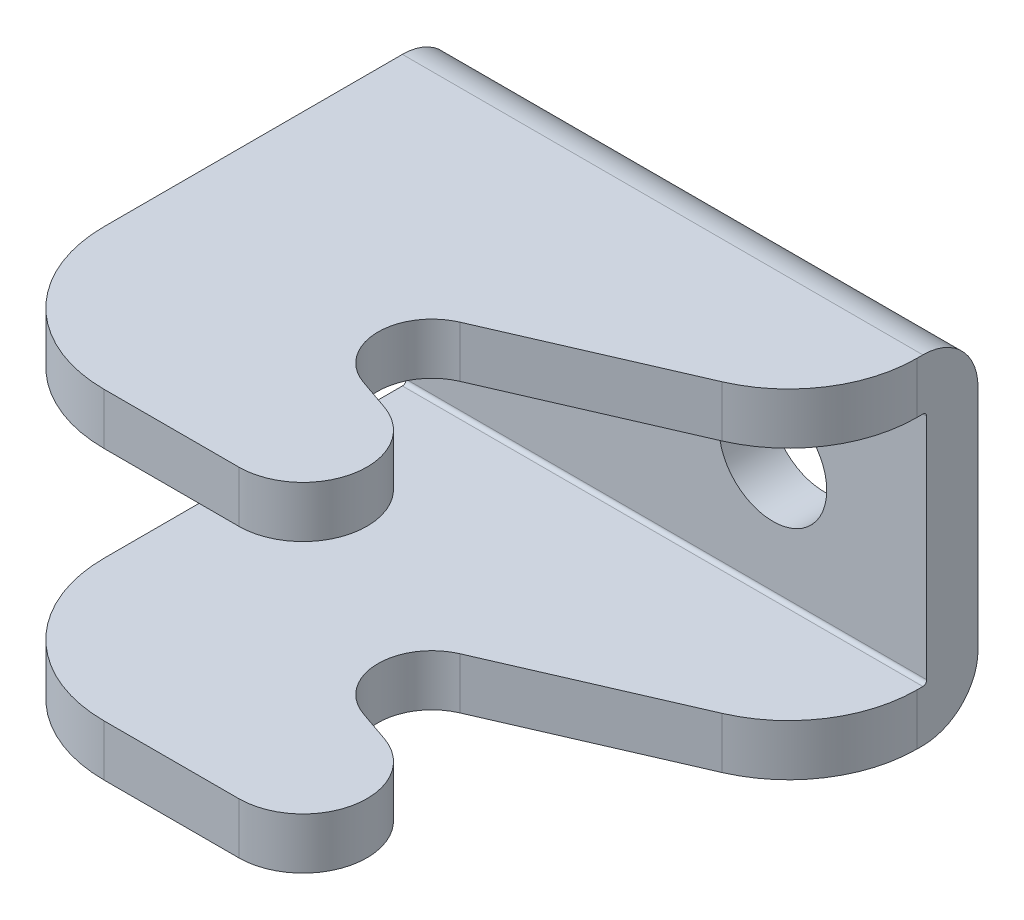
ISO-10303-21;
HEADER;
FILE_DESCRIPTION(('STEP AP214'),'2;1');
FILE_NAME('part.step','',(''),(''),'','','');
FILE_SCHEMA(('AUTOMOTIVE_DESIGN { 1 0 10303 214 1 1 1 1 }'));
ENDSEC;
DATA;
#1=APPLICATION_CONTEXT('core data for automotive mechanical design processes');
#2=APPLICATION_PROTOCOL_DEFINITION('international standard','automotive_design',2000,#1);
#3=PRODUCT_CONTEXT('',#1,'mechanical');
#4=PRODUCT('Part','Part','',(#3));
#5=PRODUCT_RELATED_PRODUCT_CATEGORY('part','',(#4));
#6=PRODUCT_DEFINITION_FORMATION('','',#4);
#7=PRODUCT_DEFINITION_CONTEXT('part definition',#1,'design');
#8=PRODUCT_DEFINITION('design','',#6,#7);
#9=PRODUCT_DEFINITION_SHAPE('','',#8);
#10=(LENGTH_UNIT() NAMED_UNIT(*) SI_UNIT(.MILLI.,.METRE.));
#11=(NAMED_UNIT(*) PLANE_ANGLE_UNIT() SI_UNIT($,.RADIAN.));
#12=(NAMED_UNIT(*) SI_UNIT($,.STERADIAN.) SOLID_ANGLE_UNIT());
#13=UNCERTAINTY_MEASURE_WITH_UNIT(LENGTH_MEASURE(1.E-05),#10,'distance_accuracy_value','');
#14=(GEOMETRIC_REPRESENTATION_CONTEXT(3) GLOBAL_UNCERTAINTY_ASSIGNED_CONTEXT((#13)) GLOBAL_UNIT_ASSIGNED_CONTEXT((#10,
#11,#12)) REPRESENTATION_CONTEXT('',''));
#15=CARTESIAN_POINT('',(0.,0.,0.));
#16=DIRECTION('',(0.,0.,1.));
#17=DIRECTION('',(1.,0.,0.));
#18=AXIS2_PLACEMENT_3D('',#15,#16,#17);
#19=CARTESIAN_POINT('',(36.7623990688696,23.3239179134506,2.30527748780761));
#20=DIRECTION('',(-0.326614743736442,0.,0.945157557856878));
#21=DIRECTION('',(0.945157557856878,0.,0.326614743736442));
#22=AXIS2_PLACEMENT_3D('',#19,#20,#21);
#23=PLANE('',#22);
#24=DIRECTION('',(0.,1.,0.));
#25=VECTOR('',#24,1.);
#26=CARTESIAN_POINT('',(38.0148268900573,23.3239179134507,2.7380745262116));
#27=LINE('',#26,#25);
#28=CARTESIAN_POINT('',(38.0148268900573,23.3239179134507,2.73807452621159));
#29=VERTEX_POINT('',#28);
#30=CARTESIAN_POINT('',(38.0148268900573,25.3239179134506,2.73807452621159));
#31=VERTEX_POINT('',#30);
#32=EDGE_CURVE('E209',#29,#31,#27,.T.);
#33=ORIENTED_EDGE('',*,*,#32,.F.);
#34=DIRECTION('',(0.945157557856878,0.,0.326614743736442));
#35=VECTOR('',#34,1.);
#36=CARTESIAN_POINT('',(36.7623990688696,23.3239179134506,2.30527748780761));
#37=LINE('',#36,#35);
#38=CARTESIAN_POINT('',(36.7623990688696,23.3239179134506,2.30527748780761));
#39=VERTEX_POINT('',#38);
#40=EDGE_CURVE('E222',#39,#29,#37,.T.);
#41=ORIENTED_EDGE('',*,*,#40,.F.);
#42=DIRECTION('',(0.,1.,0.));
#43=VECTOR('',#42,1.);
#44=CARTESIAN_POINT('',(36.7623990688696,23.3239179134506,2.30527748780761));
#45=LINE('',#44,#43);
#46=CARTESIAN_POINT('',(36.7623990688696,25.3239179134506,2.3052774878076));
#47=VERTEX_POINT('',#46);
#48=EDGE_CURVE('E215',#39,#47,#45,.T.);
#49=ORIENTED_EDGE('',*,*,#48,.T.);
#50=DIRECTION('',(0.945157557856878,0.,0.326614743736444));
#51=VECTOR('',#50,1.);
#52=CARTESIAN_POINT('',(36.7623990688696,25.3239179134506,2.3052774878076));
#53=LINE('',#52,#51);
#54=EDGE_CURVE('E182',#47,#31,#53,.T.);
#55=ORIENTED_EDGE('',*,*,#54,.T.);
#56=EDGE_LOOP('',(#33,#41,#49,#55));
#57=FACE_BOUND('',#56,.T.);
#58=ADVANCED_FACE('F14',(#57),#23,.F.);
#59=CARTESIAN_POINT('',(31.9482900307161,25.3239179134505,2.10096842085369));
#60=DIRECTION('',(0.,-1.,0.));
#61=DIRECTION('',(1.,0.,0.));
#62=AXIS2_PLACEMENT_3D('',#59,#60,#61);
#63=PLANE('',#62);
#64=DIRECTION('',(0.,0.,1.));
#65=VECTOR('',#64,1.);
#66=CARTESIAN_POINT('',(26.4482900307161,25.3239179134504,2.10096842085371));
#67=LINE('',#66,#65);
#68=CARTESIAN_POINT('',(26.4482900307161,25.3239179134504,-9.52955338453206));
#69=VERTEX_POINT('',#68);
#70=CARTESIAN_POINT('',(26.4482900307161,25.3239179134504,2.10096842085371));
#71=VERTEX_POINT('',#70);
#72=EDGE_CURVE('E196',#69,#71,#67,.T.);
#73=ORIENTED_EDGE('',*,*,#72,.T.);
#74=CARTESIAN_POINT('',(31.9482900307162,25.3239179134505,2.10096842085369));
#75=DIRECTION('',(0.,1.,0.));
#76=DIRECTION('',(-1.,0.,0.));
#77=AXIS2_PLACEMENT_3D('',#74,#75,#76);
#78=CIRCLE('',#77,5.5);
#79=CARTESIAN_POINT('',(31.9482900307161,25.3239179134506,7.60096842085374));
#80=VERTEX_POINT('',#79);
#81=EDGE_CURVE('E204',#80,#71,#78,.F.);
#82=ORIENTED_EDGE('',*,*,#81,.F.);
#83=DIRECTION('',(-1.,0.,0.));
#84=VECTOR('',#83,1.);
#85=CARTESIAN_POINT('',(37.1982900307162,25.3239179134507,7.60096842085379));
#86=LINE('',#85,#84);
#87=CARTESIAN_POINT('',(37.1982900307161,25.3239179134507,7.60096842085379));
#88=VERTEX_POINT('',#87);
#89=EDGE_CURVE('E207',#80,#88,#86,.F.);
#90=ORIENTED_EDGE('',*,*,#89,.T.);
#91=CARTESIAN_POINT('',(37.1982900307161,25.3239179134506,5.10096842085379));
#92=DIRECTION('',(0.,1.,0.));
#93=DIRECTION('',(-1.,0.,0.));
#94=AXIS2_PLACEMENT_3D('',#91,#92,#93);
#95=CIRCLE('',#94,2.5);
#96=EDGE_CURVE('E208',#31,#88,#95,.F.);
#97=ORIENTED_EDGE('',*,*,#96,.F.);
#98=ORIENTED_EDGE('',*,*,#54,.F.);
#99=CARTESIAN_POINT('',(37.4482900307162,25.3239179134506,0.320446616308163));
#100=DIRECTION('',(0.,1.,0.));
#101=DIRECTION('',(-1.,0.,0.));
#102=AXIS2_PLACEMENT_3D('',#99,#100,#101);
#103=CIRCLE('',#102,2.1);
#104=CARTESIAN_POINT('',(36.6109646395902,25.3239179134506,-1.60540025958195));
#105=VERTEX_POINT('',#104);
#106=EDGE_CURVE('E212',#47,#105,#103,.F.);
#107=ORIENTED_EDGE('',*,*,#106,.T.);
#108=DIRECTION('',(-0.917069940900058,0.,0.398726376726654));
#109=VECTOR('',#108,1.);
#110=CARTESIAN_POINT('',(43.7419219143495,25.3239179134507,-4.70581891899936));
#111=LINE('',#110,#109);
#112=CARTESIAN_POINT('',(43.7419219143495,25.3239179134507,-4.70581891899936));
#113=VERTEX_POINT('',#112);
#114=EDGE_CURVE('E178',#105,#113,#111,.F.);
#115=ORIENTED_EDGE('',*,*,#114,.T.);
#116=CARTESIAN_POINT('',(41.7482900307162,25.3239179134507,-9.2911686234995));
#117=DIRECTION('',(0.,1.,0.));
#118=DIRECTION('',(-1.,0.,0.));
#119=AXIS2_PLACEMENT_3D('',#116,#117,#118);
#120=CIRCLE('',#119,4.99999999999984);
#121=CARTESIAN_POINT('',(46.7482900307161,25.3239179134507,-9.29116862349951));
#122=VERTEX_POINT('',#121);
#123=EDGE_CURVE('E17',#122,#113,#120,.F.);
#124=ORIENTED_EDGE('',*,*,#123,.F.);
#125=DIRECTION('',(0.,0.,1.));
#126=VECTOR('',#125,1.);
#127=CARTESIAN_POINT('',(46.7482900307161,25.3239179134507,-21.2035576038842));
#128=LINE('',#127,#126);
#129=CARTESIAN_POINT('',(46.7482900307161,25.3239179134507,-9.52955338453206));
#130=VERTEX_POINT('',#129);
#131=EDGE_CURVE('E175',#122,#130,#128,.F.);
#132=ORIENTED_EDGE('',*,*,#131,.T.);
#133=DIRECTION('',(-1.,0.,0.));
#134=VECTOR('',#133,1.);
#135=CARTESIAN_POINT('',(57.0359352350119,25.3239179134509,-9.52955338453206));
#136=LINE('',#135,#134);
#137=EDGE_CURVE('E219',#130,#69,#136,.T.);
#138=ORIENTED_EDGE('',*,*,#137,.T.);
#139=EDGE_LOOP('',(#73,#82,#90,#97,#98,#107,#115,#124,#132,#138));
#140=FACE_BOUND('',#139,.T.);
#141=ADVANCED_FACE('F173',(#140),#63,.F.);
#142=CARTESIAN_POINT('',(41.7482900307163,23.3239179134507,-9.2911686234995));
#143=DIRECTION('',(0.,1.,0.));
#144=DIRECTION('',(-1.,0.,0.));
#145=AXIS2_PLACEMENT_3D('',#142,#143,#144);
#146=CYLINDRICAL_SURFACE('',#145,4.99999999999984);
#147=CARTESIAN_POINT('',(41.7482900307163,23.3239179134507,-9.2911686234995));
#148=DIRECTION('',(0.,1.,0.));
#149=DIRECTION('',(-1.,0.,0.));
#150=AXIS2_PLACEMENT_3D('',#147,#148,#149);
#151=CIRCLE('',#150,4.99999999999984);
#152=CARTESIAN_POINT('',(46.7482900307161,23.3239179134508,-9.2911686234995));
#153=VERTEX_POINT('',#152);
#154=CARTESIAN_POINT('',(43.7419219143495,23.3239179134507,-4.70581891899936));
#155=VERTEX_POINT('',#154);
#156=EDGE_CURVE('E187',#153,#155,#151,.F.);
#157=ORIENTED_EDGE('',*,*,#156,.F.);
#158=DIRECTION('',(0.,-1.,0.));
#159=VECTOR('',#158,1.);
#160=CARTESIAN_POINT('',(46.7482900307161,23.3239179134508,-9.2911686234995));
#161=LINE('',#160,#159);
#162=EDGE_CURVE('E184',#153,#122,#161,.F.);
#163=ORIENTED_EDGE('',*,*,#162,.T.);
#164=ORIENTED_EDGE('',*,*,#123,.T.);
#165=DIRECTION('',(0.,1.,0.));
#166=VECTOR('',#165,1.);
#167=CARTESIAN_POINT('',(43.7419219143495,23.3239179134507,-4.70581891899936));
#168=LINE('',#167,#166);
#169=EDGE_CURVE('E181',#113,#155,#168,.F.);
#170=ORIENTED_EDGE('',*,*,#169,.T.);
#171=EDGE_LOOP('',(#157,#163,#164,#170));
#172=FACE_BOUND('',#171,.T.);
#173=ADVANCED_FACE('F185',(#172),#146,.T.);
#174=CARTESIAN_POINT('',(43.7419219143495,23.3239179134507,-4.70581891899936));
#175=DIRECTION('',(-0.398726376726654,0.,-0.917069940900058));
#176=DIRECTION('',(-0.917069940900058,0.,0.398726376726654));
#177=AXIS2_PLACEMENT_3D('',#174,#175,#176);
#178=PLANE('',#177);
#179=DIRECTION('',(0.,1.,0.));
#180=VECTOR('',#179,1.);
#181=CARTESIAN_POINT('',(36.6109646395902,23.3239179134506,-1.60540025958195));
#182=LINE('',#181,#180);
#183=CARTESIAN_POINT('',(36.6109646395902,23.3239179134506,-1.60540025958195));
#184=VERTEX_POINT('',#183);
#185=EDGE_CURVE('E213',#105,#184,#182,.F.);
#186=ORIENTED_EDGE('',*,*,#185,.T.);
#187=DIRECTION('',(-0.917069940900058,0.,0.398726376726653));
#188=VECTOR('',#187,1.);
#189=CARTESIAN_POINT('',(43.7419219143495,23.3239179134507,-4.70581891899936));
#190=LINE('',#189,#188);
#191=EDGE_CURVE('E309',#155,#184,#190,.T.);
#192=ORIENTED_EDGE('',*,*,#191,.F.);
#193=ORIENTED_EDGE('',*,*,#169,.F.);
#194=ORIENTED_EDGE('',*,*,#114,.F.);
#195=EDGE_LOOP('',(#186,#192,#193,#194));
#196=FACE_BOUND('',#195,.T.);
#197=ADVANCED_FACE('F324',(#196),#178,.F.);
#198=CARTESIAN_POINT('',(37.4482900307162,23.3239179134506,0.32044661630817));
#199=DIRECTION('',(0.,1.,0.));
#200=DIRECTION('',(-1.,0.,0.));
#201=AXIS2_PLACEMENT_3D('',#198,#199,#200);
#202=CYLINDRICAL_SURFACE('',#201,2.1);
#203=ORIENTED_EDGE('',*,*,#48,.F.);
#204=CARTESIAN_POINT('',(37.4482900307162,23.3239179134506,0.32044661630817));
#205=DIRECTION('',(0.,1.,0.));
#206=DIRECTION('',(-1.,0.,0.));
#207=AXIS2_PLACEMENT_3D('',#204,#205,#206);
#208=CIRCLE('',#207,2.1);
#209=EDGE_CURVE('E306',#184,#39,#208,.T.);
#210=ORIENTED_EDGE('',*,*,#209,.F.);
#211=ORIENTED_EDGE('',*,*,#185,.F.);
#212=ORIENTED_EDGE('',*,*,#106,.F.);
#213=EDGE_LOOP('',(#203,#210,#211,#212));
#214=FACE_BOUND('',#213,.T.);
#215=ADVANCED_FACE('F320',(#214),#202,.F.);
#216=CARTESIAN_POINT('',(37.1982900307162,23.3239179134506,5.10096842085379));
#217=DIRECTION('',(0.,1.,0.));
#218=DIRECTION('',(-1.,0.,0.));
#219=AXIS2_PLACEMENT_3D('',#216,#217,#218);
#220=CYLINDRICAL_SURFACE('',#219,2.5);
#221=ORIENTED_EDGE('',*,*,#96,.T.);
#222=DIRECTION('',(0.,1.,0.));
#223=VECTOR('',#222,1.);
#224=CARTESIAN_POINT('',(37.1982900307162,23.3239179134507,7.60096842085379));
#225=LINE('',#224,#223);
#226=CARTESIAN_POINT('',(37.1982900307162,23.3239179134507,7.60096842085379));
#227=VERTEX_POINT('',#226);
#228=EDGE_CURVE('E205',#88,#227,#225,.F.);
#229=ORIENTED_EDGE('',*,*,#228,.T.);
#230=CARTESIAN_POINT('',(37.1982900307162,23.3239179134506,5.10096842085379));
#231=DIRECTION('',(0.,1.,0.));
#232=DIRECTION('',(-1.,0.,0.));
#233=AXIS2_PLACEMENT_3D('',#230,#231,#232);
#234=CIRCLE('',#233,2.5);
#235=EDGE_CURVE('E303',#29,#227,#234,.F.);
#236=ORIENTED_EDGE('',*,*,#235,.F.);
#237=ORIENTED_EDGE('',*,*,#32,.T.);
#238=EDGE_LOOP('',(#221,#229,#236,#237));
#239=FACE_BOUND('',#238,.T.);
#240=ADVANCED_FACE('F643',(#239),#220,.T.);
#241=CARTESIAN_POINT('',(37.1982900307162,23.3239179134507,7.60096842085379));
#242=DIRECTION('',(0.,0.,-1.));
#243=DIRECTION('',(-1.,0.,0.));
#244=AXIS2_PLACEMENT_3D('',#241,#242,#243);
#245=PLANE('',#244);
#246=DIRECTION('',(0.,1.,0.));
#247=VECTOR('',#246,1.);
#248=CARTESIAN_POINT('',(31.9482900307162,23.3239179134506,7.60096842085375));
#249=LINE('',#248,#247);
#250=CARTESIAN_POINT('',(31.9482900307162,23.3239179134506,7.60096842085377));
#251=VERTEX_POINT('',#250);
#252=EDGE_CURVE('E189',#251,#80,#249,.T.);
#253=ORIENTED_EDGE('',*,*,#252,.F.);
#254=DIRECTION('',(1.,0.,0.));
#255=VECTOR('',#254,1.);
#256=CARTESIAN_POINT('',(31.9482900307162,23.3239179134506,7.60096842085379));
#257=LINE('',#256,#255);
#258=EDGE_CURVE('E302',#227,#251,#257,.F.);
#259=ORIENTED_EDGE('',*,*,#258,.F.);
#260=ORIENTED_EDGE('',*,*,#228,.F.);
#261=ORIENTED_EDGE('',*,*,#89,.F.);
#262=EDGE_LOOP('',(#253,#259,#260,#261));
#263=FACE_BOUND('',#262,.T.);
#264=ADVANCED_FACE('F365',(#263),#245,.F.);
#265=CARTESIAN_POINT('',(31.9482900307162,23.3239179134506,2.10096842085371));
#266=DIRECTION('',(0.,1.,0.));
#267=DIRECTION('',(-1.,0.,0.));
#268=AXIS2_PLACEMENT_3D('',#265,#266,#267);
#269=CYLINDRICAL_SURFACE('',#268,5.5);
#270=CARTESIAN_POINT('',(31.9482900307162,23.3239179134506,2.10096842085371));
#271=DIRECTION('',(0.,1.,0.));
#272=DIRECTION('',(-1.,0.,0.));
#273=AXIS2_PLACEMENT_3D('',#270,#271,#272);
#274=CIRCLE('',#273,5.5);
#275=CARTESIAN_POINT('',(26.4482900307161,23.3239179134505,2.10096842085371));
#276=VERTEX_POINT('',#275);
#277=EDGE_CURVE('E299',#251,#276,#274,.F.);
#278=ORIENTED_EDGE('',*,*,#277,.F.);
#279=ORIENTED_EDGE('',*,*,#252,.T.);
#280=ORIENTED_EDGE('',*,*,#81,.T.);
#281=DIRECTION('',(0.,1.,0.));
#282=VECTOR('',#281,1.);
#283=CARTESIAN_POINT('',(26.4482900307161,23.3239179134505,2.10096842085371));
#284=LINE('',#283,#282);
#285=EDGE_CURVE('E198',#71,#276,#284,.F.);
#286=ORIENTED_EDGE('',*,*,#285,.T.);
#287=EDGE_LOOP('',(#278,#279,#280,#286));
#288=FACE_BOUND('',#287,.T.);
#289=ADVANCED_FACE('F368',(#288),#269,.T.);
#290=CARTESIAN_POINT('',(57.0359352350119,25.4739179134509,-9.52955338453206));
#291=DIRECTION('',(-1.,0.,0.));
#292=DIRECTION('',(0.,-1.,0.));
#293=AXIS2_PLACEMENT_3D('',#290,#291,#292);
#294=CYLINDRICAL_SURFACE('',#293,0.15);
#295=CARTESIAN_POINT('',(26.4482900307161,25.4739179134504,-9.52955338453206));
#296=DIRECTION('',(-1.,0.,0.));
#297=DIRECTION('',(0.,-1.,0.));
#298=AXIS2_PLACEMENT_3D('',#295,#296,#297);
#299=CIRCLE('',#298,0.15);
#300=CARTESIAN_POINT('',(26.4482900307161,25.4739179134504,-9.67955338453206));
#301=VERTEX_POINT('',#300);
#302=EDGE_CURVE('E295',#69,#301,#299,.F.);
#303=ORIENTED_EDGE('',*,*,#302,.F.);
#304=ORIENTED_EDGE('',*,*,#137,.F.);
#305=CARTESIAN_POINT('',(46.7482900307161,25.4739179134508,-9.52955338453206));
#306=DIRECTION('',(-1.,0.,0.));
#307=DIRECTION('',(0.,-1.,0.));
#308=AXIS2_PLACEMENT_3D('',#305,#306,#307);
#309=CIRCLE('',#308,0.15);
#310=CARTESIAN_POINT('',(46.7482900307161,25.4739179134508,-9.67955338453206));
#311=VERTEX_POINT('',#310);
#312=EDGE_CURVE('E195',#311,#130,#309,.T.);
#313=ORIENTED_EDGE('',*,*,#312,.F.);
#314=DIRECTION('',(-1.,0.,0.));
#315=VECTOR('',#314,1.);
#316=CARTESIAN_POINT('',(31.9482900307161,25.4739179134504,-9.67955338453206));
#317=LINE('',#316,#315);
#318=EDGE_CURVE('E294',#311,#301,#317,.T.);
#319=ORIENTED_EDGE('',*,*,#318,.T.);
#320=EDGE_LOOP('',(#303,#304,#313,#319));
#321=FACE_BOUND('',#320,.T.);
#322=ADVANCED_FACE('F344',(#321),#294,.F.);
#323=CARTESIAN_POINT('',(31.9482900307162,23.3239179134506,2.10096842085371));
#324=DIRECTION('',(0.,-1.,0.));
#325=DIRECTION('',(1.,0.,0.));
#326=AXIS2_PLACEMENT_3D('',#323,#324,#325);
#327=PLANE('',#326);
#328=ORIENTED_EDGE('',*,*,#258,.T.);
#329=ORIENTED_EDGE('',*,*,#277,.T.);
#330=DIRECTION('',(0.,0.,1.));
#331=VECTOR('',#330,1.);
#332=CARTESIAN_POINT('',(26.4482900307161,23.3239179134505,2.10096842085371));
#333=LINE('',#332,#331);
#334=CARTESIAN_POINT('',(26.4482900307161,23.3239179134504,-9.52955338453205));
#335=VERTEX_POINT('',#334);
#336=EDGE_CURVE('E331',#276,#335,#333,.F.);
#337=ORIENTED_EDGE('',*,*,#336,.T.);
#338=DIRECTION('',(-1.,0.,0.));
#339=VECTOR('',#338,1.);
#340=CARTESIAN_POINT('',(57.0359352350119,23.3239179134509,-9.52955338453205));
#341=LINE('',#340,#339);
#342=CARTESIAN_POINT('',(46.7482900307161,23.3239179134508,-9.52955338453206));
#343=VERTEX_POINT('',#342);
#344=EDGE_CURVE('E290',#343,#335,#341,.T.);
#345=ORIENTED_EDGE('',*,*,#344,.F.);
#346=DIRECTION('',(0.,0.,1.));
#347=VECTOR('',#346,1.);
#348=CARTESIAN_POINT('',(46.7482900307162,23.3239179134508,2.10096842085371));
#349=LINE('',#348,#347);
#350=EDGE_CURVE('E311',#343,#153,#349,.T.);
#351=ORIENTED_EDGE('',*,*,#350,.T.);
#352=ORIENTED_EDGE('',*,*,#156,.T.);
#353=ORIENTED_EDGE('',*,*,#191,.T.);
#354=ORIENTED_EDGE('',*,*,#209,.T.);
#355=ORIENTED_EDGE('',*,*,#40,.T.);
#356=ORIENTED_EDGE('',*,*,#235,.T.);
#357=EDGE_LOOP('',(#328,#329,#337,#345,#351,#352,#353,#354,#355,#356));
#358=FACE_BOUND('',#357,.T.);
#359=ADVANCED_FACE('F328',(#358),#327,.T.);
#360=CARTESIAN_POINT('',(31.9482900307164,12.575586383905,-9.67955338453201));
#361=DIRECTION('',(0.,0.,-1.));
#362=DIRECTION('',(-1.,0.,0.));
#363=AXIS2_PLACEMENT_3D('',#360,#361,#362);
#364=PLANE('',#363);
#365=ORIENTED_EDGE('',*,*,#318,.F.);
#366=DIRECTION('',(0.,-1.,0.));
#367=VECTOR('',#366,1.);
#368=CARTESIAN_POINT('',(46.7482900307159,35.8801124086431,-9.67955338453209));
#369=LINE('',#368,#367);
#370=CARTESIAN_POINT('',(46.748290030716,34.3739179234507,-9.67955338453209));
#371=VERTEX_POINT('',#370);
#372=EDGE_CURVE('E287',#311,#371,#369,.F.);
#373=ORIENTED_EDGE('',*,*,#372,.T.);
#374=DIRECTION('',(1.,0.,0.));
#375=VECTOR('',#374,1.);
#376=CARTESIAN_POINT('',(16.1606448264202,34.3739179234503,-9.67955338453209));
#377=LINE('',#376,#375);
#378=CARTESIAN_POINT('',(26.4482900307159,34.3739179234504,-9.67955338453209));
#379=VERTEX_POINT('',#378);
#380=EDGE_CURVE('E279',#371,#379,#377,.F.);
#381=ORIENTED_EDGE('',*,*,#380,.T.);
#382=DIRECTION('',(0.,1.,0.));
#383=VECTOR('',#382,1.);
#384=CARTESIAN_POINT('',(26.4482900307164,12.5755863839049,-9.67955338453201));
#385=LINE('',#384,#383);
#386=EDGE_CURVE('E283',#379,#301,#385,.F.);
#387=ORIENTED_EDGE('',*,*,#386,.T.);
#388=EDGE_LOOP('',(#365,#373,#381,#387));
#389=FACE_BOUND('',#388,.T.);
#390=CARTESIAN_POINT('',(40.748290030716,29.9239179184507,-9.67955338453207));
#391=DIRECTION('',(0.,0.,1.));
#392=DIRECTION('',(1.,0.,0.));
#393=AXIS2_PLACEMENT_3D('',#390,#391,#392);
#394=CIRCLE('',#393,2.1);
#395=CARTESIAN_POINT('',(42.848290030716,29.9239179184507,-9.67955338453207));
#396=VERTEX_POINT('',#395);
#397=EDGE_CURVE('E280',#396,#396,#394,.F.);
#398=ORIENTED_EDGE('',*,*,#397,.T.);
#399=EDGE_LOOP('',(#398));
#400=FACE_BOUND('',#399,.T.);
#401=CARTESIAN_POINT('',(30.7482900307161,29.9239179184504,-9.67955338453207));
#402=DIRECTION('',(0.,0.,1.));
#403=DIRECTION('',(1.,0.,0.));
#404=AXIS2_PLACEMENT_3D('',#401,#402,#403);
#405=CIRCLE('',#404,2.1);
#406=CARTESIAN_POINT('',(32.8482900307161,29.9239179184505,-9.67955338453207));
#407=VERTEX_POINT('',#406);
#408=EDGE_CURVE('E284',#407,#407,#405,.F.);
#409=ORIENTED_EDGE('',*,*,#408,.T.);
#410=EDGE_LOOP('',(#409));
#411=FACE_BOUND('',#410,.T.);
#412=ADVANCED_FACE('F349',(#389,#400,#411),#364,.F.);
#413=CARTESIAN_POINT('',(57.0359352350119,25.4739179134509,-9.52955338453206));
#414=DIRECTION('',(-1.,0.,0.));
#415=DIRECTION('',(0.,-1.,0.));
#416=AXIS2_PLACEMENT_3D('',#413,#414,#415);
#417=CYLINDRICAL_SURFACE('',#416,2.15);
#418=ORIENTED_EDGE('',*,*,#344,.T.);
#419=CARTESIAN_POINT('',(26.4482900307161,25.4739179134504,-9.52955338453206));
#420=DIRECTION('',(-1.,0.,0.));
#421=DIRECTION('',(0.,-1.,0.));
#422=AXIS2_PLACEMENT_3D('',#419,#420,#421);
#423=CIRCLE('',#422,2.15);
#424=CARTESIAN_POINT('',(26.4482900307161,25.4739179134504,-11.6795533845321));
#425=VERTEX_POINT('',#424);
#426=EDGE_CURVE('E288',#335,#425,#423,.F.);
#427=ORIENTED_EDGE('',*,*,#426,.T.);
#428=DIRECTION('',(-1.,0.,0.));
#429=VECTOR('',#428,1.);
#430=CARTESIAN_POINT('',(31.9482900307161,25.4739179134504,-11.6795533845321));
#431=LINE('',#430,#429);
#432=CARTESIAN_POINT('',(46.7482900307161,25.4739179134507,-11.6795533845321));
#433=VERTEX_POINT('',#432);
#434=EDGE_CURVE('E278',#433,#425,#431,.T.);
#435=ORIENTED_EDGE('',*,*,#434,.F.);
#436=CARTESIAN_POINT('',(46.7482900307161,25.4739179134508,-9.52955338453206));
#437=DIRECTION('',(-1.,0.,0.));
#438=DIRECTION('',(0.,-1.,0.));
#439=AXIS2_PLACEMENT_3D('',#436,#437,#438);
#440=CIRCLE('',#439,2.15);
#441=EDGE_CURVE('E291',#433,#343,#440,.T.);
#442=ORIENTED_EDGE('',*,*,#441,.T.);
#443=EDGE_LOOP('',(#418,#427,#435,#442));
#444=FACE_BOUND('',#443,.T.);
#445=ADVANCED_FACE('F374',(#444),#417,.T.);
#446=CARTESIAN_POINT('',(30.7482900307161,29.9239179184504,-9.67955338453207));
#447=DIRECTION('',(0.,0.,1.));
#448=DIRECTION('',(1.,0.,0.));
#449=AXIS2_PLACEMENT_3D('',#446,#447,#448);
#450=CYLINDRICAL_SURFACE('',#449,2.1);
#451=CARTESIAN_POINT('',(30.7482900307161,29.9239179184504,-11.6795533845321));
#452=DIRECTION('',(0.,0.,1.));
#453=DIRECTION('',(1.,0.,0.));
#454=AXIS2_PLACEMENT_3D('',#451,#452,#453);
#455=CIRCLE('',#454,2.1);
#456=CARTESIAN_POINT('',(32.8482900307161,29.9239179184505,-11.6795533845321));
#457=VERTEX_POINT('',#456);
#458=EDGE_CURVE('E271',#457,#457,#455,.T.);
#459=ORIENTED_EDGE('',*,*,#458,.F.);
#460=EDGE_LOOP('',(#459));
#461=FACE_BOUND('',#460,.T.);
#462=ORIENTED_EDGE('',*,*,#408,.F.);
#463=EDGE_LOOP('',(#462));
#464=FACE_BOUND('',#463,.T.);
#465=ADVANCED_FACE('F584',(#461,#464),#450,.F.);
#466=CARTESIAN_POINT('',(40.748290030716,29.9239179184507,-9.67955338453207));
#467=DIRECTION('',(0.,0.,1.));
#468=DIRECTION('',(1.,0.,0.));
#469=AXIS2_PLACEMENT_3D('',#466,#467,#468);
#470=CYLINDRICAL_SURFACE('',#469,2.1);
#471=CARTESIAN_POINT('',(40.748290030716,29.9239179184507,-11.6795533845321));
#472=DIRECTION('',(0.,0.,1.));
#473=DIRECTION('',(1.,0.,0.));
#474=AXIS2_PLACEMENT_3D('',#471,#472,#473);
#475=CIRCLE('',#474,2.1);
#476=CARTESIAN_POINT('',(42.848290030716,29.9239179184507,-11.6795533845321));
#477=VERTEX_POINT('',#476);
#478=EDGE_CURVE('E268',#477,#477,#475,.T.);
#479=ORIENTED_EDGE('',*,*,#478,.F.);
#480=EDGE_LOOP('',(#479));
#481=FACE_BOUND('',#480,.T.);
#482=ORIENTED_EDGE('',*,*,#397,.F.);
#483=EDGE_LOOP('',(#482));
#484=FACE_BOUND('',#483,.T.);
#485=ADVANCED_FACE('F575',(#481,#484),#470,.F.);
#486=CARTESIAN_POINT('',(16.1606448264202,34.3739179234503,-9.52955338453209));
#487=DIRECTION('',(1.,0.,0.));
#488=DIRECTION('',(0.,1.,0.));
#489=AXIS2_PLACEMENT_3D('',#486,#487,#488);
#490=CYLINDRICAL_SURFACE('',#489,0.15);
#491=DIRECTION('',(-1.,0.,0.));
#492=VECTOR('',#491,1.);
#493=CARTESIAN_POINT('',(31.948290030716,34.5239179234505,-9.5295533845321));
#494=LINE('',#493,#492);
#495=CARTESIAN_POINT('',(46.748290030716,34.5239179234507,-9.52955338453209));
#496=VERTEX_POINT('',#495);
#497=CARTESIAN_POINT('',(26.4482900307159,34.5239179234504,-9.5295533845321));
#498=VERTEX_POINT('',#497);
#499=EDGE_CURVE('E399',#496,#498,#494,.T.);
#500=ORIENTED_EDGE('',*,*,#499,.T.);
#501=CARTESIAN_POINT('',(26.4482900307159,34.3739179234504,-9.52955338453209));
#502=DIRECTION('',(1.,0.,0.));
#503=DIRECTION('',(0.,1.,0.));
#504=AXIS2_PLACEMENT_3D('',#501,#502,#503);
#505=CIRCLE('',#504,0.15);
#506=EDGE_CURVE('E264',#379,#498,#505,.T.);
#507=ORIENTED_EDGE('',*,*,#506,.F.);
#508=ORIENTED_EDGE('',*,*,#380,.F.);
#509=CARTESIAN_POINT('',(46.748290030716,34.3739179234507,-9.52955338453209));
#510=DIRECTION('',(1.,0.,0.));
#511=DIRECTION('',(0.,1.,0.));
#512=AXIS2_PLACEMENT_3D('',#509,#510,#511);
#513=CIRCLE('',#512,0.15);
#514=EDGE_CURVE('E275',#496,#371,#513,.F.);
#515=ORIENTED_EDGE('',*,*,#514,.F.);
#516=EDGE_LOOP('',(#500,#507,#508,#515));
#517=FACE_BOUND('',#516,.T.);
#518=ADVANCED_FACE('F413',(#517),#490,.F.);
#519=CARTESIAN_POINT('',(31.9482900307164,12.5755863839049,-11.679553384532));
#520=DIRECTION('',(0.,0.,-1.));
#521=DIRECTION('',(-1.,0.,0.));
#522=AXIS2_PLACEMENT_3D('',#519,#520,#521);
#523=PLANE('',#522);
#524=ORIENTED_EDGE('',*,*,#478,.T.);
#525=EDGE_LOOP('',(#524));
#526=FACE_BOUND('',#525,.T.);
#527=ORIENTED_EDGE('',*,*,#458,.T.);
#528=EDGE_LOOP('',(#527));
#529=FACE_BOUND('',#528,.T.);
#530=DIRECTION('',(1.,0.,0.));
#531=VECTOR('',#530,1.);
#532=CARTESIAN_POINT('',(16.1606448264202,34.3739179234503,-11.6795533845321));
#533=LINE('',#532,#531);
#534=CARTESIAN_POINT('',(46.748290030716,34.3739179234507,-11.6795533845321));
#535=VERTEX_POINT('',#534);
#536=CARTESIAN_POINT('',(26.4482900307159,34.3739179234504,-11.6795533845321));
#537=VERTEX_POINT('',#536);
#538=EDGE_CURVE('E259',#535,#537,#533,.F.);
#539=ORIENTED_EDGE('',*,*,#538,.F.);
#540=DIRECTION('',(0.,1.,0.));
#541=VECTOR('',#540,1.);
#542=CARTESIAN_POINT('',(46.7482900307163,12.5755863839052,-11.679553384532));
#543=LINE('',#542,#541);
#544=EDGE_CURVE('E274',#535,#433,#543,.F.);
#545=ORIENTED_EDGE('',*,*,#544,.T.);
#546=ORIENTED_EDGE('',*,*,#434,.T.);
#547=DIRECTION('',(0.,1.,0.));
#548=VECTOR('',#547,1.);
#549=CARTESIAN_POINT('',(26.4482900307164,12.5755863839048,-11.679553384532));
#550=LINE('',#549,#548);
#551=EDGE_CURVE('E359',#425,#537,#550,.T.);
#552=ORIENTED_EDGE('',*,*,#551,.T.);
#553=EDGE_LOOP('',(#539,#545,#546,#552));
#554=FACE_BOUND('',#553,.T.);
#555=ADVANCED_FACE('F379',(#526,#529,#554),#523,.T.);
#556=CARTESIAN_POINT('',(38.014826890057,36.5239179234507,2.73807452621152));
#557=DIRECTION('',(-0.326614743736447,0.,0.945157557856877));
#558=DIRECTION('',(0.945157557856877,0.,0.326614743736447));
#559=AXIS2_PLACEMENT_3D('',#556,#557,#558);
#560=PLANE('',#559);
#561=DIRECTION('',(0.,-1.,0.));
#562=VECTOR('',#561,1.);
#563=CARTESIAN_POINT('',(36.7623990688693,36.5239179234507,2.30527748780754));
#564=LINE('',#563,#562);
#565=CARTESIAN_POINT('',(36.7623990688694,34.5239179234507,2.30527748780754));
#566=VERTEX_POINT('',#565);
#567=CARTESIAN_POINT('',(36.7623990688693,36.5239179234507,2.30527748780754));
#568=VERTEX_POINT('',#567);
#569=EDGE_CURVE('E247',#566,#568,#564,.F.);
#570=ORIENTED_EDGE('',*,*,#569,.T.);
#571=DIRECTION('',(0.945157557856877,0.,0.326614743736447));
#572=VECTOR('',#571,1.);
#573=CARTESIAN_POINT('',(38.014826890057,36.5239179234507,2.73807452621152));
#574=LINE('',#573,#572);
#575=CARTESIAN_POINT('',(38.014826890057,36.5239179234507,2.73807452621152));
#576=VERTEX_POINT('',#575);
#577=EDGE_CURVE('E267',#576,#568,#574,.F.);
#578=ORIENTED_EDGE('',*,*,#577,.F.);
#579=DIRECTION('',(0.,-1.,0.));
#580=VECTOR('',#579,1.);
#581=CARTESIAN_POINT('',(38.0148268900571,36.5239179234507,2.73807452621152));
#582=LINE('',#581,#580);
#583=CARTESIAN_POINT('',(38.0148268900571,34.5239179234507,2.73807452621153));
#584=VERTEX_POINT('',#583);
#585=EDGE_CURVE('E251',#584,#576,#582,.F.);
#586=ORIENTED_EDGE('',*,*,#585,.F.);
#587=DIRECTION('',(-0.945157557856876,0.,-0.326614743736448));
#588=VECTOR('',#587,1.);
#589=CARTESIAN_POINT('',(38.0148268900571,34.5239179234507,2.73807452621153));
#590=LINE('',#589,#588);
#591=EDGE_CURVE('E401',#584,#566,#590,.T.);
#592=ORIENTED_EDGE('',*,*,#591,.T.);
#593=EDGE_LOOP('',(#570,#578,#586,#592));
#594=FACE_BOUND('',#593,.T.);
#595=ADVANCED_FACE('F451',(#594),#560,.F.);
#596=CARTESIAN_POINT('',(31.948290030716,34.5239179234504,-32.5956946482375));
#597=DIRECTION('',(0.,1.,0.));
#598=DIRECTION('',(-1.,0.,0.));
#599=AXIS2_PLACEMENT_3D('',#596,#597,#598);
#600=PLANE('',#599);
#601=ORIENTED_EDGE('',*,*,#499,.F.);
#602=DIRECTION('',(0.,0.,1.));
#603=VECTOR('',#602,1.);
#604=CARTESIAN_POINT('',(46.748290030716,34.5239179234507,-9.29116862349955));
#605=LINE('',#604,#603);
#606=CARTESIAN_POINT('',(46.748290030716,34.5239179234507,-9.29116862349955));
#607=VERTEX_POINT('',#606);
#608=EDGE_CURVE('E263',#496,#607,#605,.T.);
#609=ORIENTED_EDGE('',*,*,#608,.T.);
#610=CARTESIAN_POINT('',(41.7482900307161,34.5239179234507,-9.29116862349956));
#611=DIRECTION('',(0.,-1.,0.));
#612=DIRECTION('',(1.,0.,0.));
#613=AXIS2_PLACEMENT_3D('',#610,#611,#612);
#614=CIRCLE('',#613,4.99999999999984);
#615=CARTESIAN_POINT('',(43.7419219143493,34.5239179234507,-4.70581891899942));
#616=VERTEX_POINT('',#615);
#617=EDGE_CURVE('E238',#616,#607,#614,.F.);
#618=ORIENTED_EDGE('',*,*,#617,.F.);
#619=DIRECTION('',(-0.917069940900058,0.,0.398726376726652));
#620=VECTOR('',#619,1.);
#621=CARTESIAN_POINT('',(36.6109646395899,34.5239179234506,-1.60540025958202));
#622=LINE('',#621,#620);
#623=CARTESIAN_POINT('',(36.61096463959,34.5239179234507,-1.60540025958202));
#624=VERTEX_POINT('',#623);
#625=EDGE_CURVE('E242',#616,#624,#622,.T.);
#626=ORIENTED_EDGE('',*,*,#625,.T.);
#627=CARTESIAN_POINT('',(37.448290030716,34.5239179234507,0.320446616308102));
#628=DIRECTION('',(0.,-1.,0.));
#629=DIRECTION('',(1.,0.,0.));
#630=AXIS2_PLACEMENT_3D('',#627,#628,#629);
#631=CIRCLE('',#630,2.1);
#632=EDGE_CURVE('E243',#624,#566,#631,.F.);
#633=ORIENTED_EDGE('',*,*,#632,.T.);
#634=ORIENTED_EDGE('',*,*,#591,.F.);
#635=CARTESIAN_POINT('',(37.198290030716,34.5239179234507,5.10096842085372));
#636=DIRECTION('',(0.,-1.,0.));
#637=DIRECTION('',(1.,0.,0.));
#638=AXIS2_PLACEMENT_3D('',#635,#636,#637);
#639=CIRCLE('',#638,2.5);
#640=CARTESIAN_POINT('',(37.198290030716,34.5239179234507,7.60096842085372));
#641=VERTEX_POINT('',#640);
#642=EDGE_CURVE('E248',#641,#584,#639,.F.);
#643=ORIENTED_EDGE('',*,*,#642,.F.);
#644=DIRECTION('',(-1.,0.,0.));
#645=VECTOR('',#644,1.);
#646=CARTESIAN_POINT('',(31.948290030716,34.5239179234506,7.60096842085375));
#647=LINE('',#646,#645);
#648=CARTESIAN_POINT('',(31.948290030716,34.5239179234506,7.60096842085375));
#649=VERTEX_POINT('',#648);
#650=EDGE_CURVE('E404',#641,#649,#647,.T.);
#651=ORIENTED_EDGE('',*,*,#650,.T.);
#652=CARTESIAN_POINT('',(31.948290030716,34.5239179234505,2.10096842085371));
#653=DIRECTION('',(0.,-1.,0.));
#654=DIRECTION('',(1.,0.,0.));
#655=AXIS2_PLACEMENT_3D('',#652,#653,#654);
#656=CIRCLE('',#655,5.5);
#657=CARTESIAN_POINT('',(26.4482900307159,34.5239179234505,2.10096842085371));
#658=VERTEX_POINT('',#657);
#659=EDGE_CURVE('E253',#658,#649,#656,.F.);
#660=ORIENTED_EDGE('',*,*,#659,.F.);
#661=DIRECTION('',(0.,0.,1.));
#662=VECTOR('',#661,1.);
#663=CARTESIAN_POINT('',(26.448290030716,34.5239179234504,-32.5956946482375));
#664=LINE('',#663,#662);
#665=EDGE_CURVE('E256',#658,#498,#664,.F.);
#666=ORIENTED_EDGE('',*,*,#665,.T.);
#667=EDGE_LOOP('',(#601,#609,#618,#626,#633,#634,#643,#651,#660,#666));
#668=FACE_BOUND('',#667,.T.);
#669=ADVANCED_FACE('F416',(#668),#600,.F.);
#670=CARTESIAN_POINT('',(46.7482900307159,36.5239179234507,-9.29116862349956));
#671=DIRECTION('',(-1.,0.,0.));
#672=DIRECTION('',(0.,-1.,0.));
#673=AXIS2_PLACEMENT_3D('',#670,#671,#672);
#674=PLANE('',#673);
#675=ORIENTED_EDGE('',*,*,#608,.F.);
#676=ORIENTED_EDGE('',*,*,#514,.T.);
#677=ORIENTED_EDGE('',*,*,#372,.F.);
#678=ORIENTED_EDGE('',*,*,#312,.T.);
#679=ORIENTED_EDGE('',*,*,#131,.F.);
#680=ORIENTED_EDGE('',*,*,#162,.F.);
#681=ORIENTED_EDGE('',*,*,#350,.F.);
#682=ORIENTED_EDGE('',*,*,#441,.F.);
#683=ORIENTED_EDGE('',*,*,#544,.F.);
#684=CARTESIAN_POINT('',(46.748290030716,34.3739179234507,-9.52955338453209));
#685=DIRECTION('',(1.,0.,0.));
#686=DIRECTION('',(0.,1.,0.));
#687=AXIS2_PLACEMENT_3D('',#684,#685,#686);
#688=CIRCLE('',#687,2.15);
#689=CARTESIAN_POINT('',(46.7482900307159,36.5239179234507,-9.5295533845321));
#690=VERTEX_POINT('',#689);
#691=EDGE_CURVE('E260',#690,#535,#688,.F.);
#692=ORIENTED_EDGE('',*,*,#691,.F.);
#693=DIRECTION('',(0.,0.,1.));
#694=VECTOR('',#693,1.);
#695=CARTESIAN_POINT('',(46.7482900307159,36.5239179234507,-9.29116862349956));
#696=LINE('',#695,#694);
#697=CARTESIAN_POINT('',(46.7482900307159,36.5239179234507,-9.29116862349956));
#698=VERTEX_POINT('',#697);
#699=EDGE_CURVE('E32',#698,#690,#696,.F.);
#700=ORIENTED_EDGE('',*,*,#699,.F.);
#701=DIRECTION('',(0.,-1.,0.));
#702=VECTOR('',#701,1.);
#703=CARTESIAN_POINT('',(46.7482900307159,36.5239179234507,-9.29116862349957));
#704=LINE('',#703,#702);
#705=EDGE_CURVE('E241',#607,#698,#704,.F.);
#706=ORIENTED_EDGE('',*,*,#705,.F.);
#707=EDGE_LOOP('',(#675,#676,#677,#678,#679,#680,#681,#682,#683,#692,#700,#706));
#708=FACE_BOUND('',#707,.T.);
#709=ADVANCED_FACE('F193',(#708),#674,.F.);
#710=CARTESIAN_POINT('',(16.1606448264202,34.3739179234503,-9.52955338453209));
#711=DIRECTION('',(1.,0.,0.));
#712=DIRECTION('',(0.,1.,0.));
#713=AXIS2_PLACEMENT_3D('',#710,#711,#712);
#714=CYLINDRICAL_SURFACE('',#713,2.15);
#715=CARTESIAN_POINT('',(26.4482900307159,34.3739179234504,-9.52955338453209));
#716=DIRECTION('',(1.,0.,0.));
#717=DIRECTION('',(0.,1.,0.));
#718=AXIS2_PLACEMENT_3D('',#715,#716,#717);
#719=CIRCLE('',#718,2.15);
#720=CARTESIAN_POINT('',(26.4482900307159,36.5239179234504,-9.5295533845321));
#721=VERTEX_POINT('',#720);
#722=EDGE_CURVE('E257',#537,#721,#719,.T.);
#723=ORIENTED_EDGE('',*,*,#722,.T.);
#724=DIRECTION('',(-1.,0.,0.));
#725=VECTOR('',#724,1.);
#726=CARTESIAN_POINT('',(31.948290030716,36.5239179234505,-9.52955338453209));
#727=LINE('',#726,#725);
#728=EDGE_CURVE('E385',#690,#721,#727,.T.);
#729=ORIENTED_EDGE('',*,*,#728,.F.);
#730=ORIENTED_EDGE('',*,*,#691,.T.);
#731=ORIENTED_EDGE('',*,*,#538,.T.);
#732=EDGE_LOOP('',(#723,#729,#730,#731));
#733=FACE_BOUND('',#732,.T.);
#734=ADVANCED_FACE('F383',(#733),#714,.T.);
#735=CARTESIAN_POINT('',(26.4482900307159,36.5239179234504,-32.5956946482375));
#736=DIRECTION('',(1.,0.,0.));
#737=DIRECTION('',(0.,1.,0.));
#738=AXIS2_PLACEMENT_3D('',#735,#736,#737);
#739=PLANE('',#738);
#740=DIRECTION('',(0.,0.,1.));
#741=VECTOR('',#740,1.);
#742=CARTESIAN_POINT('',(26.4482900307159,36.5239179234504,-32.5956946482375));
#743=LINE('',#742,#741);
#744=CARTESIAN_POINT('',(26.4482900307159,36.5239179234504,2.10096842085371));
#745=VERTEX_POINT('',#744);
#746=EDGE_CURVE('E237',#721,#745,#743,.T.);
#747=ORIENTED_EDGE('',*,*,#746,.F.);
#748=ORIENTED_EDGE('',*,*,#722,.F.);
#749=ORIENTED_EDGE('',*,*,#551,.F.);
#750=ORIENTED_EDGE('',*,*,#426,.F.);
#751=ORIENTED_EDGE('',*,*,#336,.F.);
#752=ORIENTED_EDGE('',*,*,#285,.F.);
#753=ORIENTED_EDGE('',*,*,#72,.F.);
#754=ORIENTED_EDGE('',*,*,#302,.T.);
#755=ORIENTED_EDGE('',*,*,#386,.F.);
#756=ORIENTED_EDGE('',*,*,#506,.T.);
#757=ORIENTED_EDGE('',*,*,#665,.F.);
#758=DIRECTION('',(0.,-1.,0.));
#759=VECTOR('',#758,1.);
#760=CARTESIAN_POINT('',(26.4482900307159,36.5239179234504,2.1009684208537));
#761=LINE('',#760,#759);
#762=EDGE_CURVE('E255',#745,#658,#761,.T.);
#763=ORIENTED_EDGE('',*,*,#762,.F.);
#764=EDGE_LOOP('',(#747,#748,#749,#750,#751,#752,#753,#754,#755,#756,#757,#763));
#765=FACE_BOUND('',#764,.T.);
#766=ADVANCED_FACE('F341',(#765),#739,.F.);
#767=CARTESIAN_POINT('',(31.9482900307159,36.5239179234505,2.10096842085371));
#768=DIRECTION('',(0.,-1.,0.));
#769=DIRECTION('',(1.,0.,0.));
#770=AXIS2_PLACEMENT_3D('',#767,#768,#769);
#771=CYLINDRICAL_SURFACE('',#770,5.5);
#772=CARTESIAN_POINT('',(31.9482900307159,36.5239179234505,2.10096842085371));
#773=DIRECTION('',(0.,-1.,0.));
#774=DIRECTION('',(1.,0.,0.));
#775=AXIS2_PLACEMENT_3D('',#772,#773,#774);
#776=CIRCLE('',#775,5.5);
#777=CARTESIAN_POINT('',(31.9482900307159,36.5239179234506,7.60096842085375));
#778=VERTEX_POINT('',#777);
#779=EDGE_CURVE('E234',#745,#778,#776,.F.);
#780=ORIENTED_EDGE('',*,*,#779,.F.);
#781=ORIENTED_EDGE('',*,*,#762,.T.);
#782=ORIENTED_EDGE('',*,*,#659,.T.);
#783=DIRECTION('',(0.,1.,0.));
#784=VECTOR('',#783,1.);
#785=CARTESIAN_POINT('',(31.9482900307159,36.5239179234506,7.60096842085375));
#786=LINE('',#785,#784);
#787=EDGE_CURVE('E407',#649,#778,#786,.T.);
#788=ORIENTED_EDGE('',*,*,#787,.T.);
#789=EDGE_LOOP('',(#780,#781,#782,#788));
#790=FACE_BOUND('',#789,.T.);
#791=ADVANCED_FACE('F420',(#790),#771,.T.);
#792=CARTESIAN_POINT('',(31.9482900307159,36.5239179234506,7.60096842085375));
#793=DIRECTION('',(0.,0.,-1.));
#794=DIRECTION('',(-1.,0.,0.));
#795=AXIS2_PLACEMENT_3D('',#792,#793,#794);
#796=PLANE('',#795);
#797=DIRECTION('',(0.,-1.,0.));
#798=VECTOR('',#797,1.);
#799=CARTESIAN_POINT('',(37.1982900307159,36.5239179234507,7.60096842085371));
#800=LINE('',#799,#798);
#801=CARTESIAN_POINT('',(37.1982900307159,36.5239179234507,7.60096842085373));
#802=VERTEX_POINT('',#801);
#803=EDGE_CURVE('E252',#802,#641,#800,.T.);
#804=ORIENTED_EDGE('',*,*,#803,.F.);
#805=DIRECTION('',(-1.,0.,0.));
#806=VECTOR('',#805,1.);
#807=CARTESIAN_POINT('',(31.948290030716,36.5239179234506,7.60096842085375));
#808=LINE('',#807,#806);
#809=EDGE_CURVE('E233',#778,#802,#808,.F.);
#810=ORIENTED_EDGE('',*,*,#809,.F.);
#811=ORIENTED_EDGE('',*,*,#787,.F.);
#812=ORIENTED_EDGE('',*,*,#650,.F.);
#813=EDGE_LOOP('',(#804,#810,#811,#812));
#814=FACE_BOUND('',#813,.T.);
#815=ADVANCED_FACE('F457',(#814),#796,.F.);
#816=CARTESIAN_POINT('',(37.1982900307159,36.5239179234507,5.10096842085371));
#817=DIRECTION('',(0.,-1.,0.));
#818=DIRECTION('',(1.,0.,0.));
#819=AXIS2_PLACEMENT_3D('',#816,#817,#818);
#820=CYLINDRICAL_SURFACE('',#819,2.5);
#821=ORIENTED_EDGE('',*,*,#642,.T.);
#822=ORIENTED_EDGE('',*,*,#585,.T.);
#823=CARTESIAN_POINT('',(37.1982900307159,36.5239179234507,5.10096842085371));
#824=DIRECTION('',(0.,-1.,0.));
#825=DIRECTION('',(1.,0.,0.));
#826=AXIS2_PLACEMENT_3D('',#823,#824,#825);
#827=CIRCLE('',#826,2.5);
#828=EDGE_CURVE('E231',#802,#576,#827,.F.);
#829=ORIENTED_EDGE('',*,*,#828,.F.);
#830=ORIENTED_EDGE('',*,*,#803,.T.);
#831=EDGE_LOOP('',(#821,#822,#829,#830));
#832=FACE_BOUND('',#831,.T.);
#833=ADVANCED_FACE('F454',(#832),#820,.T.);
#834=CARTESIAN_POINT('',(37.4482900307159,36.5239179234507,0.320446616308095));
#835=DIRECTION('',(0.,-1.,0.));
#836=DIRECTION('',(1.,0.,0.));
#837=AXIS2_PLACEMENT_3D('',#834,#835,#836);
#838=CYLINDRICAL_SURFACE('',#837,2.1);
#839=DIRECTION('',(0.,1.,0.));
#840=VECTOR('',#839,1.);
#841=CARTESIAN_POINT('',(36.6109646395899,36.5239179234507,-1.60540025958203));
#842=LINE('',#841,#840);
#843=CARTESIAN_POINT('',(36.6109646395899,36.5239179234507,-1.60540025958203));
#844=VERTEX_POINT('',#843);
#845=EDGE_CURVE('E246',#624,#844,#842,.T.);
#846=ORIENTED_EDGE('',*,*,#845,.T.);
#847=CARTESIAN_POINT('',(37.4482900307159,36.5239179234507,0.320446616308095));
#848=DIRECTION('',(0.,-1.,0.));
#849=DIRECTION('',(1.,0.,0.));
#850=AXIS2_PLACEMENT_3D('',#847,#848,#849);
#851=CIRCLE('',#850,2.1);
#852=EDGE_CURVE('E228',#568,#844,#851,.T.);
#853=ORIENTED_EDGE('',*,*,#852,.F.);
#854=ORIENTED_EDGE('',*,*,#569,.F.);
#855=ORIENTED_EDGE('',*,*,#632,.F.);
#856=EDGE_LOOP('',(#846,#853,#854,#855));
#857=FACE_BOUND('',#856,.T.);
#858=ADVANCED_FACE('F448',(#857),#838,.F.);
#859=CARTESIAN_POINT('',(36.6109646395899,36.5239179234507,-1.60540025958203));
#860=DIRECTION('',(-0.398726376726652,0.,-0.917069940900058));
#861=DIRECTION('',(-0.917069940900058,0.,0.398726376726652));
#862=AXIS2_PLACEMENT_3D('',#859,#860,#861);
#863=PLANE('',#862);
#864=DIRECTION('',(0.,-1.,0.));
#865=VECTOR('',#864,1.);
#866=CARTESIAN_POINT('',(43.7419219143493,36.5239179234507,-4.70581891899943));
#867=LINE('',#866,#865);
#868=CARTESIAN_POINT('',(43.7419219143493,36.5239179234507,-4.70581891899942));
#869=VERTEX_POINT('',#868);
#870=EDGE_CURVE('E388',#869,#616,#867,.T.);
#871=ORIENTED_EDGE('',*,*,#870,.F.);
#872=DIRECTION('',(0.917069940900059,0.,-0.398726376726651));
#873=VECTOR('',#872,1.);
#874=CARTESIAN_POINT('',(36.6109646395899,36.5239179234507,-1.60540025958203));
#875=LINE('',#874,#873);
#876=EDGE_CURVE('E23',#844,#869,#875,.T.);
#877=ORIENTED_EDGE('',*,*,#876,.F.);
#878=ORIENTED_EDGE('',*,*,#845,.F.);
#879=ORIENTED_EDGE('',*,*,#625,.F.);
#880=EDGE_LOOP('',(#871,#877,#878,#879));
#881=FACE_BOUND('',#880,.T.);
#882=ADVANCED_FACE('F441',(#881),#863,.F.);
#883=CARTESIAN_POINT('',(41.7482900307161,36.5239179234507,-9.29116862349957));
#884=DIRECTION('',(0.,-1.,0.));
#885=DIRECTION('',(1.,0.,0.));
#886=AXIS2_PLACEMENT_3D('',#883,#884,#885);
#887=CYLINDRICAL_SURFACE('',#886,4.99999999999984);
#888=CARTESIAN_POINT('',(41.7482900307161,36.5239179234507,-9.29116862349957));
#889=DIRECTION('',(0.,-1.,0.));
#890=DIRECTION('',(1.,0.,0.));
#891=AXIS2_PLACEMENT_3D('',#888,#889,#890);
#892=CIRCLE('',#891,4.99999999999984);
#893=EDGE_CURVE('E9',#869,#698,#892,.F.);
#894=ORIENTED_EDGE('',*,*,#893,.F.);
#895=ORIENTED_EDGE('',*,*,#870,.T.);
#896=ORIENTED_EDGE('',*,*,#617,.T.);
#897=ORIENTED_EDGE('',*,*,#705,.T.);
#898=EDGE_LOOP('',(#894,#895,#896,#897));
#899=FACE_BOUND('',#898,.T.);
#900=ADVANCED_FACE('F444',(#899),#887,.T.);
#901=CARTESIAN_POINT('',(31.948290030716,36.5239179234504,-32.5956946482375));
#902=DIRECTION('',(0.,1.,0.));
#903=DIRECTION('',(-1.,0.,0.));
#904=AXIS2_PLACEMENT_3D('',#901,#902,#903);
#905=PLANE('',#904);
#906=ORIENTED_EDGE('',*,*,#893,.T.);
#907=ORIENTED_EDGE('',*,*,#699,.T.);
#908=ORIENTED_EDGE('',*,*,#728,.T.);
#909=ORIENTED_EDGE('',*,*,#746,.T.);
#910=ORIENTED_EDGE('',*,*,#779,.T.);
#911=ORIENTED_EDGE('',*,*,#809,.T.);
#912=ORIENTED_EDGE('',*,*,#828,.T.);
#913=ORIENTED_EDGE('',*,*,#577,.T.);
#914=ORIENTED_EDGE('',*,*,#852,.T.);
#915=ORIENTED_EDGE('',*,*,#876,.T.);
#916=EDGE_LOOP('',(#906,#907,#908,#909,#910,#911,#912,#913,#914,#915));
#917=FACE_BOUND('',#916,.T.);
#918=ADVANCED_FACE('F436',(#917),#905,.T.);
#919=CLOSED_SHELL('',(#58,#141,#173,#197,#215,#240,#264,#289,#322,#359,#412,#445,#465,#485,#518,
#555,#595,#669,#709,#734,#766,#791,#815,#833,#858,#882,#900,#918));
#920=MANIFOLD_SOLID_BREP('B1',#919);
#921=ADVANCED_BREP_SHAPE_REPRESENTATION('',(#18,#920),#14);
#922=SHAPE_DEFINITION_REPRESENTATION(#9,#921);
ENDSEC;
END-ISO-10303-21;
